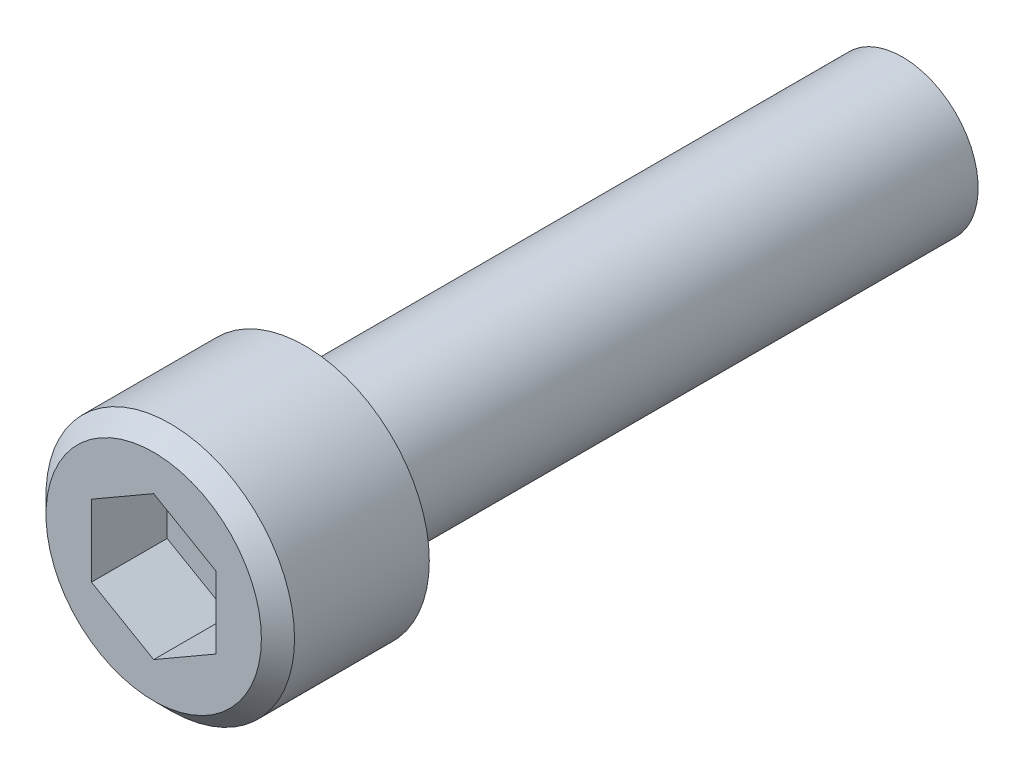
ISO-10303-21;
HEADER;
FILE_DESCRIPTION(('STEP AP214'),'2;1');
FILE_NAME('part.step','',(''),(''),'','','');
FILE_SCHEMA(('AUTOMOTIVE_DESIGN { 1 0 10303 214 1 1 1 1 }'));
ENDSEC;
DATA;
#1=APPLICATION_CONTEXT('core data for automotive mechanical design processes');
#2=APPLICATION_PROTOCOL_DEFINITION('international standard','automotive_design',2000,#1);
#3=PRODUCT_CONTEXT('',#1,'mechanical');
#4=PRODUCT('Part','Part','',(#3));
#5=PRODUCT_RELATED_PRODUCT_CATEGORY('part','',(#4));
#6=PRODUCT_DEFINITION_FORMATION('','',#4);
#7=PRODUCT_DEFINITION_CONTEXT('part definition',#1,'design');
#8=PRODUCT_DEFINITION('design','',#6,#7);
#9=PRODUCT_DEFINITION_SHAPE('','',#8);
#10=(LENGTH_UNIT() NAMED_UNIT(*) SI_UNIT(.MILLI.,.METRE.));
#11=(NAMED_UNIT(*) PLANE_ANGLE_UNIT() SI_UNIT($,.RADIAN.));
#12=(NAMED_UNIT(*) SI_UNIT($,.STERADIAN.) SOLID_ANGLE_UNIT());
#13=UNCERTAINTY_MEASURE_WITH_UNIT(LENGTH_MEASURE(1.E-05),#10,'distance_accuracy_value','');
#14=(GEOMETRIC_REPRESENTATION_CONTEXT(3) GLOBAL_UNCERTAINTY_ASSIGNED_CONTEXT((#13)) GLOBAL_UNIT_ASSIGNED_CONTEXT((#10,
#11,#12)) REPRESENTATION_CONTEXT('',''));
#15=CARTESIAN_POINT('',(0.,0.,0.));
#16=DIRECTION('',(0.,0.,1.));
#17=DIRECTION('',(1.,0.,0.));
#18=AXIS2_PLACEMENT_3D('',#15,#16,#17);
#19=CARTESIAN_POINT('',(8.88178419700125E-13,0.,19.0500000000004));
#20=DIRECTION('',(0.,0.,-1.));
#21=DIRECTION('',(-0.99999999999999,0.,0.));
#22=AXIS2_PLACEMENT_3D('',#19,#20,#21);
#23=CYLINDRICAL_SURFACE('',#22,2.413);
#24=CARTESIAN_POINT('',(8.88178419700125E-13,0.,18.6944000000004));
#25=DIRECTION('',(0.,0.,1.));
#26=DIRECTION('',(0.99999999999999,0.,0.));
#27=AXIS2_PLACEMENT_3D('',#24,#25,#26);
#28=CIRCLE('',#27,2.413);
#29=CARTESIAN_POINT('',(-2.41299999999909,0.,18.6944000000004));
#30=VERTEX_POINT('',#29);
#31=EDGE_CURVE('E149',#30,#30,#28,.F.);
#32=CARTESIAN_POINT('',(-1.11022302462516E-13,0.,0.));
#33=DIRECTION('',(0.,0.,1.));
#34=DIRECTION('',(0.99999999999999,0.,0.));
#35=AXIS2_PLACEMENT_3D('',#32,#33,#34);
#36=CIRCLE('',#35,2.413);
#37=CARTESIAN_POINT('',(-2.41299999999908,0.,0.));
#38=VERTEX_POINT('',#37);
#39=EDGE_CURVE('E143',#38,#38,#36,.T.);
#40=CARTESIAN_POINT('',(-2.41299999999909,0.,18.6944000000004));
#41=CARTESIAN_POINT('',(-2.41299999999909,0.,18.499666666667));
#42=CARTESIAN_POINT('',(-2.41299999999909,0.,18.3049333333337));
#43=CARTESIAN_POINT('',(-2.41299999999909,0.,17.915466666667));
#44=CARTESIAN_POINT('',(-2.41299999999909,0.,17.7207333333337));
#45=CARTESIAN_POINT('',(-2.41299999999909,0.,17.331266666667));
#46=CARTESIAN_POINT('',(-2.41299999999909,0.,17.1365333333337));
#47=CARTESIAN_POINT('',(-2.41299999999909,0.,16.747066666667));
#48=CARTESIAN_POINT('',(-2.41299999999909,0.,16.5523333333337));
#49=CARTESIAN_POINT('',(-2.41299999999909,0.,16.162866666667));
#50=CARTESIAN_POINT('',(-2.41299999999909,0.,15.9681333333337));
#51=CARTESIAN_POINT('',(-2.41299999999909,0.,15.578666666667));
#52=CARTESIAN_POINT('',(-2.41299999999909,0.,15.3839333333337));
#53=CARTESIAN_POINT('',(-2.41299999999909,0.,14.994466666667));
#54=CARTESIAN_POINT('',(-2.41299999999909,0.,14.7997333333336));
#55=CARTESIAN_POINT('',(-2.41299999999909,0.,14.410266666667));
#56=CARTESIAN_POINT('',(-2.41299999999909,0.,14.2155333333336));
#57=CARTESIAN_POINT('',(-2.41299999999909,0.,13.826066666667));
#58=CARTESIAN_POINT('',(-2.41299999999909,0.,13.6313333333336));
#59=CARTESIAN_POINT('',(-2.41299999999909,0.,13.2418666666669));
#60=CARTESIAN_POINT('',(-2.41299999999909,0.,13.0471333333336));
#61=CARTESIAN_POINT('',(-2.41299999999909,0.,12.6576666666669));
#62=CARTESIAN_POINT('',(-2.41299999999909,0.,12.4629333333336));
#63=CARTESIAN_POINT('',(-2.41299999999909,0.,12.0734666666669));
#64=CARTESIAN_POINT('',(-2.41299999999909,0.,11.8787333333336));
#65=CARTESIAN_POINT('',(-2.41299999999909,0.,11.4892666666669));
#66=CARTESIAN_POINT('',(-2.41299999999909,0.,11.2945333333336));
#67=CARTESIAN_POINT('',(-2.41299999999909,0.,10.9050666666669));
#68=CARTESIAN_POINT('',(-2.41299999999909,0.,10.7103333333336));
#69=CARTESIAN_POINT('',(-2.41299999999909,0.,10.3208666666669));
#70=CARTESIAN_POINT('',(-2.41299999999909,0.,10.1261333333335));
#71=CARTESIAN_POINT('',(-2.41299999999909,0.,9.73666666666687));
#72=CARTESIAN_POINT('',(-2.41299999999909,0.,9.54193333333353));
#73=CARTESIAN_POINT('',(-2.41299999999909,0.,9.15246666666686));
#74=CARTESIAN_POINT('',(-2.41299999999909,0.,8.95773333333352));
#75=CARTESIAN_POINT('',(-2.41299999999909,0.,8.56826666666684));
#76=CARTESIAN_POINT('',(-2.41299999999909,0.,8.3735333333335));
#77=CARTESIAN_POINT('',(-2.41299999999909,0.,7.98406666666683));
#78=CARTESIAN_POINT('',(-2.41299999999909,0.,7.78933333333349));
#79=CARTESIAN_POINT('',(-2.41299999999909,0.,7.39986666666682));
#80=CARTESIAN_POINT('',(-2.41299999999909,0.,7.20513333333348));
#81=CARTESIAN_POINT('',(-2.41299999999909,0.,6.81566666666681));
#82=CARTESIAN_POINT('',(-2.41299999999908,0.,6.62093333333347));
#83=CARTESIAN_POINT('',(-2.41299999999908,0.,6.23146666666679));
#84=CARTESIAN_POINT('',(-2.41299999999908,0.,6.03673333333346));
#85=CARTESIAN_POINT('',(-2.41299999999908,0.,5.64726666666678));
#86=CARTESIAN_POINT('',(-2.41299999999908,0.,5.45253333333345));
#87=CARTESIAN_POINT('',(-2.41299999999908,0.,5.06306666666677));
#88=CARTESIAN_POINT('',(-2.41299999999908,0.,4.86833333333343));
#89=CARTESIAN_POINT('',(-2.41299999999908,0.,4.47886666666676));
#90=CARTESIAN_POINT('',(-2.41299999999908,0.,4.28413333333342));
#91=CARTESIAN_POINT('',(-2.41299999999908,0.,3.89466666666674));
#92=CARTESIAN_POINT('',(-2.41299999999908,0.,3.69993333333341));
#93=CARTESIAN_POINT('',(-2.41299999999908,0.,3.31046666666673));
#94=CARTESIAN_POINT('',(-2.41299999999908,0.,3.1157333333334));
#95=CARTESIAN_POINT('',(-2.41299999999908,0.,2.72626666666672));
#96=CARTESIAN_POINT('',(-2.41299999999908,0.,2.53153333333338));
#97=CARTESIAN_POINT('',(-2.41299999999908,0.,2.14206666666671));
#98=CARTESIAN_POINT('',(-2.41299999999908,0.,1.94733333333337));
#99=CARTESIAN_POINT('',(-2.41299999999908,0.,1.5578666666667));
#100=CARTESIAN_POINT('',(-2.41299999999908,0.,1.36313333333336));
#101=CARTESIAN_POINT('',(-2.41299999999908,0.,0.973666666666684));
#102=CARTESIAN_POINT('',(-2.41299999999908,0.,0.778933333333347));
#103=CARTESIAN_POINT('',(-2.41299999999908,0.,0.389466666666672));
#104=CARTESIAN_POINT('',(-2.41299999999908,0.,0.194733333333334));
#105=CARTESIAN_POINT('',(-2.41299999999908,0.,0.));
#106=B_SPLINE_CURVE_WITH_KNOTS('',3,(#40,#41,#42,#43,#44,#45,#46,#47,#48,#49,#50,#51,#52,#53,
#54,#55,#56,#57,#58,#59,#60,#61,#62,#63,#64,#65,#66,#67,#68,#69,#70,#71,#72,#73,#74,#75,#76,#77,
#78,#79,#80,#81,#82,#83,#84,#85,#86,#87,#88,#89,#90,#91,#92,#93,#94,#95,#96,#97,#98,#99,#100,
#101,#102,#103,#104,#105),.UNSPECIFIED.,.F.,.F.,(4,2,2,2,2,2,2,2,2,2,2,2,2,2,2,2,2,2,2,2,2,2,2,
2,2,2,2,2,2,2,2,2,4),(0.,0.58420000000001,1.16840000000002,1.75260000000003,2.33680000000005,
2.92100000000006,3.50520000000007,4.08940000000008,4.6736000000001,5.25780000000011,
5.84200000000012,6.42620000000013,7.01040000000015,7.59460000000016,8.17880000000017,
8.76300000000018,9.34720000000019,9.9314000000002,10.5156000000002,11.0998000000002,
11.6840000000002,12.2682000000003,12.8524000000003,13.4366000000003,14.0208000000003,
14.6050000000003,15.1892000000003,15.7734000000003,16.3576000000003,16.9418000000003,
17.5260000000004,18.1102000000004,18.6944000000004),.UNSPECIFIED.);
#107=EDGE_CURVE('BSEAM36',#30,#38,#106,.T.);
#108=ORIENTED_EDGE('',*,*,#31,.T.);
#109=ORIENTED_EDGE('',*,*,#39,.T.);
#110=ORIENTED_EDGE('',*,*,#107,.T.);
#111=ORIENTED_EDGE('',*,*,#107,.F.);
#112=EDGE_LOOP('',(#108,#110,#109,#111));
#113=FACE_BOUND('',#112,.T.);
#114=ADVANCED_FACE('F36',(#113),#23,.T.);
#115=CARTESIAN_POINT('',(-1.11022302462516E-13,0.,0.));
#116=DIRECTION('',(0.,0.,1.));
#117=DIRECTION('',(0.99999999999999,0.,0.));
#118=AXIS2_PLACEMENT_3D('',#115,#116,#117);
#119=PLANE('',#118);
#120=ORIENTED_EDGE('',*,*,#39,.F.);
#121=EDGE_LOOP('',(#120));
#122=FACE_BOUND('',#121,.T.);
#123=ADVANCED_FACE('F167',(#122),#119,.F.);
#124=CARTESIAN_POINT('',(8.88178419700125E-13,0.,19.0500000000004));
#125=DIRECTION('',(0.,0.,1.));
#126=DIRECTION('',(0.99999999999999,0.,0.));
#127=AXIS2_PLACEMENT_3D('',#124,#125,#126);
#128=PLANE('',#127);
#129=CARTESIAN_POINT('',(8.88178419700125E-13,0.,19.0500000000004));
#130=DIRECTION('',(0.,0.,1.));
#131=DIRECTION('',(0.99999999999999,0.,0.));
#132=AXIS2_PLACEMENT_3D('',#129,#130,#131);
#133=CIRCLE('',#132,2.7686);
#134=CARTESIAN_POINT('',(2.76860000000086,0.,19.0500000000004));
#135=VERTEX_POINT('',#134);
#136=EDGE_CURVE('E146',#135,#135,#133,.T.);
#137=ORIENTED_EDGE('',*,*,#136,.T.);
#138=EDGE_LOOP('',(#137));
#139=FACE_BOUND('',#138,.T.);
#140=CARTESIAN_POINT('',(8.88178419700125E-13,0.,19.0500000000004));
#141=DIRECTION('',(0.,0.,1.));
#142=DIRECTION('',(0.99999999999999,0.,0.));
#143=AXIS2_PLACEMENT_3D('',#140,#141,#142);
#144=CIRCLE('',#143,3.9624);
#145=CARTESIAN_POINT('',(3.96240000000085,0.,19.0500000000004));
#146=VERTEX_POINT('',#145);
#147=EDGE_CURVE('E134',#146,#146,#144,.T.);
#148=ORIENTED_EDGE('',*,*,#147,.F.);
#149=EDGE_LOOP('',(#148));
#150=FACE_BOUND('',#149,.T.);
#151=ADVANCED_FACE('F172',(#139,#150),#128,.F.);
#152=CARTESIAN_POINT('',(8.88178419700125E-13,0.,23.8760000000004));
#153=DIRECTION('',(0.,0.,-1.));
#154=DIRECTION('',(-0.99999999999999,0.,0.));
#155=AXIS2_PLACEMENT_3D('',#152,#153,#154);
#156=CYLINDRICAL_SURFACE('',#155,3.9624);
#157=CARTESIAN_POINT('',(8.88178419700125E-13,0.,23.3476800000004));
#158=DIRECTION('',(0.,0.,1.));
#159=DIRECTION('',(0.99999999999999,0.,0.));
#160=AXIS2_PLACEMENT_3D('',#157,#158,#159);
#161=CIRCLE('',#160,3.9624);
#162=CARTESIAN_POINT('',(3.96240000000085,0.,23.3476800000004));
#163=VERTEX_POINT('',#162);
#164=EDGE_CURVE('E11',#163,#163,#161,.F.);
#165=ORIENTED_EDGE('',*,*,#164,.T.);
#166=EDGE_LOOP('',(#165));
#167=FACE_BOUND('',#166,.T.);
#168=ORIENTED_EDGE('',*,*,#147,.T.);
#169=EDGE_LOOP('',(#168));
#170=FACE_BOUND('',#169,.T.);
#171=ADVANCED_FACE('F187',(#167,#170),#156,.T.);
#172=CARTESIAN_POINT('',(8.88178419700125E-13,0.,23.8760000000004));
#173=DIRECTION('',(0.,0.,1.));
#174=DIRECTION('',(0.99999999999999,0.,0.));
#175=AXIS2_PLACEMENT_3D('',#172,#173,#174);
#176=PLANE('',#175);
#177=CARTESIAN_POINT('',(8.88178419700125E-13,0.,23.8760000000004));
#178=DIRECTION('',(0.,0.,1.));
#179=DIRECTION('',(0.99999999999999,0.,0.));
#180=AXIS2_PLACEMENT_3D('',#177,#178,#179);
#181=CIRCLE('',#180,3.43407999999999);
#182=CARTESIAN_POINT('',(3.43408000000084,0.,23.8760000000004));
#183=VERTEX_POINT('',#182);
#184=EDGE_CURVE('E43',#183,#183,#181,.T.);
#185=ORIENTED_EDGE('',*,*,#184,.T.);
#186=EDGE_LOOP('',(#185));
#187=FACE_BOUND('',#186,.T.);
#188=DIRECTION('',(-0.866025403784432,-0.499999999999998,0.));
#189=VECTOR('',#188,1.);
#190=CARTESIAN_POINT('',(8.32667268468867E-13,2.29135888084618,23.8760000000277));
#191=LINE('',#190,#189);
#192=CARTESIAN_POINT('',(8.32667268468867E-13,2.29135888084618,23.8760000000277));
#193=VERTEX_POINT('',#192);
#194=CARTESIAN_POINT('',(-1.9843749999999,1.14567944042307,23.8760000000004));
#195=VERTEX_POINT('',#194);
#196=EDGE_CURVE('E50',#193,#195,#191,.T.);
#197=ORIENTED_EDGE('',*,*,#196,.F.);
#198=DIRECTION('',(0.866025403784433,-0.499999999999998,0.));
#199=VECTOR('',#198,1.);
#200=CARTESIAN_POINT('',(8.32667268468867E-13,2.29135888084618,23.8760000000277));
#201=LINE('',#200,#199);
#202=CARTESIAN_POINT('',(1.98437500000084,1.14567944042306,23.8760000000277));
#203=VERTEX_POINT('',#202);
#204=EDGE_CURVE('E117',#193,#203,#201,.T.);
#205=ORIENTED_EDGE('',*,*,#204,.T.);
#206=DIRECTION('',(0.,-0.999999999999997,0.));
#207=VECTOR('',#206,1.);
#208=CARTESIAN_POINT('',(1.98437500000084,1.14567944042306,23.8760000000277));
#209=LINE('',#208,#207);
#210=CARTESIAN_POINT('',(1.98437500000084,-1.14567944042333,23.8760000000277));
#211=VERTEX_POINT('',#210);
#212=EDGE_CURVE('E112',#203,#211,#209,.T.);
#213=ORIENTED_EDGE('',*,*,#212,.T.);
#214=DIRECTION('',(0.866025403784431,0.499999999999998,0.));
#215=VECTOR('',#214,1.);
#216=CARTESIAN_POINT('',(8.32667268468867E-13,-2.29135888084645,23.8760000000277));
#217=LINE('',#216,#215);
#218=CARTESIAN_POINT('',(8.32667268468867E-13,-2.29135888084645,23.8760000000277));
#219=VERTEX_POINT('',#218);
#220=EDGE_CURVE('E110',#219,#211,#217,.T.);
#221=ORIENTED_EDGE('',*,*,#220,.F.);
#222=DIRECTION('',(-0.866025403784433,0.499999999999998,0.));
#223=VECTOR('',#222,1.);
#224=CARTESIAN_POINT('',(8.32667268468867E-13,-2.29135888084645,23.8760000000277));
#225=LINE('',#224,#223);
#226=CARTESIAN_POINT('',(-1.98437499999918,-1.14567944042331,23.8760000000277));
#227=VERTEX_POINT('',#226);
#228=EDGE_CURVE('E92',#219,#227,#225,.T.);
#229=ORIENTED_EDGE('',*,*,#228,.T.);
#230=DIRECTION('',(0.,-0.999999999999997,0.));
#231=VECTOR('',#230,1.);
#232=CARTESIAN_POINT('',(-1.9843749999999,1.14567944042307,23.8760000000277));
#233=LINE('',#232,#231);
#234=EDGE_CURVE('E103',#195,#227,#233,.T.);
#235=ORIENTED_EDGE('',*,*,#234,.F.);
#236=EDGE_LOOP('',(#197,#205,#213,#221,#229,#235));
#237=FACE_BOUND('',#236,.T.);
#238=ADVANCED_FACE('F107',(#187,#237),#176,.T.);
#239=CARTESIAN_POINT('',(8.88178419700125E-13,0.,18.6944000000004));
#240=DIRECTION('',(0.,0.,1.));
#241=DIRECTION('',(0.99999999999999,0.,0.));
#242=AXIS2_PLACEMENT_3D('',#239,#240,#241);
#243=TOROIDAL_SURFACE('',#242,2.7686,0.3556);
#244=ORIENTED_EDGE('',*,*,#31,.F.);
#245=EDGE_LOOP('',(#244));
#246=FACE_BOUND('',#245,.T.);
#247=ORIENTED_EDGE('',*,*,#136,.F.);
#248=EDGE_LOOP('',(#247));
#249=FACE_BOUND('',#248,.T.);
#250=ADVANCED_FACE('F178',(#246,#249),#243,.F.);
#251=CARTESIAN_POINT('',(8.32667268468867E-13,2.29135888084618,21.4630000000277));
#252=DIRECTION('',(-0.499999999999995,0.866025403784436,0.));
#253=DIRECTION('',(-0.866025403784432,-0.499999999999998,0.));
#254=AXIS2_PLACEMENT_3D('',#251,#252,#253);
#255=PLANE('',#254);
#256=ORIENTED_EDGE('',*,*,#196,.T.);
#257=DIRECTION('',(0.,0.,1.));
#258=VECTOR('',#257,1.);
#259=CARTESIAN_POINT('',(-1.9843749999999,1.14567944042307,21.4630000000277));
#260=LINE('',#259,#258);
#261=CARTESIAN_POINT('',(-1.9843749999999,1.14567944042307,21.4630000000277));
#262=VERTEX_POINT('',#261);
#263=EDGE_CURVE('E100',#262,#195,#260,.T.);
#264=ORIENTED_EDGE('',*,*,#263,.F.);
#265=DIRECTION('',(-0.866025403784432,-0.499999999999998,0.));
#266=VECTOR('',#265,1.);
#267=CARTESIAN_POINT('',(8.32667268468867E-13,2.29135888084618,21.4630000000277));
#268=LINE('',#267,#266);
#269=CARTESIAN_POINT('',(8.32667268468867E-13,2.29135888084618,21.4630000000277));
#270=VERTEX_POINT('',#269);
#271=EDGE_CURVE('E120',#270,#262,#268,.T.);
#272=ORIENTED_EDGE('',*,*,#271,.F.);
#273=DIRECTION('',(0.,0.,1.));
#274=VECTOR('',#273,1.);
#275=CARTESIAN_POINT('',(8.32667268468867E-13,2.29135888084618,21.4630000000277));
#276=LINE('',#275,#274);
#277=EDGE_CURVE('E57',#270,#193,#276,.T.);
#278=ORIENTED_EDGE('',*,*,#277,.T.);
#279=EDGE_LOOP('',(#256,#264,#272,#278));
#280=FACE_BOUND('',#279,.T.);
#281=ADVANCED_FACE('F181',(#280),#255,.F.);
#282=CARTESIAN_POINT('',(8.32667268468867E-13,2.29135888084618,21.4630000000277));
#283=DIRECTION('',(-0.499999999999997,-0.866025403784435,0.));
#284=DIRECTION('',(0.866025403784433,-0.499999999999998,0.));
#285=AXIS2_PLACEMENT_3D('',#282,#283,#284);
#286=PLANE('',#285);
#287=ORIENTED_EDGE('',*,*,#204,.F.);
#288=ORIENTED_EDGE('',*,*,#277,.F.);
#289=DIRECTION('',(0.866025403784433,-0.499999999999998,0.));
#290=VECTOR('',#289,1.);
#291=CARTESIAN_POINT('',(8.32667268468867E-13,2.29135888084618,21.4630000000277));
#292=LINE('',#291,#290);
#293=CARTESIAN_POINT('',(1.98437500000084,1.14567944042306,21.4630000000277));
#294=VERTEX_POINT('',#293);
#295=EDGE_CURVE('E131',#270,#294,#292,.T.);
#296=ORIENTED_EDGE('',*,*,#295,.T.);
#297=DIRECTION('',(0.,0.,1.));
#298=VECTOR('',#297,1.);
#299=CARTESIAN_POINT('',(1.98437500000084,1.14567944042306,21.4630000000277));
#300=LINE('',#299,#298);
#301=EDGE_CURVE('E135',#294,#203,#300,.T.);
#302=ORIENTED_EDGE('',*,*,#301,.T.);
#303=EDGE_LOOP('',(#287,#288,#296,#302));
#304=FACE_BOUND('',#303,.T.);
#305=ADVANCED_FACE('F201',(#304),#286,.T.);
#306=CARTESIAN_POINT('',(1.98437500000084,1.14567944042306,21.4630000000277));
#307=DIRECTION('',(-0.99999999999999,0.,0.));
#308=DIRECTION('',(0.,-0.999999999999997,0.));
#309=AXIS2_PLACEMENT_3D('',#306,#307,#308);
#310=PLANE('',#309);
#311=ORIENTED_EDGE('',*,*,#212,.F.);
#312=ORIENTED_EDGE('',*,*,#301,.F.);
#313=DIRECTION('',(0.,-0.999999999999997,0.));
#314=VECTOR('',#313,1.);
#315=CARTESIAN_POINT('',(1.98437500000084,1.14567944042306,21.4630000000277));
#316=LINE('',#315,#314);
#317=CARTESIAN_POINT('',(1.98437500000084,-1.14567944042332,21.4630000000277));
#318=VERTEX_POINT('',#317);
#319=EDGE_CURVE('E129',#294,#318,#316,.T.);
#320=ORIENTED_EDGE('',*,*,#319,.T.);
#321=DIRECTION('',(0.,0.,1.));
#322=VECTOR('',#321,1.);
#323=CARTESIAN_POINT('',(1.98437500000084,-1.14567944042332,21.4630000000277));
#324=LINE('',#323,#322);
#325=EDGE_CURVE('E137',#318,#211,#324,.T.);
#326=ORIENTED_EDGE('',*,*,#325,.T.);
#327=EDGE_LOOP('',(#311,#312,#320,#326));
#328=FACE_BOUND('',#327,.T.);
#329=ADVANCED_FACE('F209',(#328),#310,.T.);
#330=CARTESIAN_POINT('',(8.32667268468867E-13,-2.29135888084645,21.4630000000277));
#331=DIRECTION('',(0.499999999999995,-0.866025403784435,0.));
#332=DIRECTION('',(0.866025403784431,0.499999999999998,0.));
#333=AXIS2_PLACEMENT_3D('',#330,#331,#332);
#334=PLANE('',#333);
#335=ORIENTED_EDGE('',*,*,#220,.T.);
#336=ORIENTED_EDGE('',*,*,#325,.F.);
#337=DIRECTION('',(0.866025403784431,0.499999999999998,0.));
#338=VECTOR('',#337,1.);
#339=CARTESIAN_POINT('',(8.32667268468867E-13,-2.29135888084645,21.4630000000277));
#340=LINE('',#339,#338);
#341=CARTESIAN_POINT('',(8.32667268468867E-13,-2.29135888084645,21.4630000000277));
#342=VERTEX_POINT('',#341);
#343=EDGE_CURVE('E126',#342,#318,#340,.T.);
#344=ORIENTED_EDGE('',*,*,#343,.F.);
#345=DIRECTION('',(0.,0.,1.));
#346=VECTOR('',#345,1.);
#347=CARTESIAN_POINT('',(8.32667268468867E-13,-2.29135888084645,21.4630000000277));
#348=LINE('',#347,#346);
#349=EDGE_CURVE('E99',#342,#219,#348,.T.);
#350=ORIENTED_EDGE('',*,*,#349,.T.);
#351=EDGE_LOOP('',(#335,#336,#344,#350));
#352=FACE_BOUND('',#351,.T.);
#353=ADVANCED_FACE('F206',(#352),#334,.F.);
#354=CARTESIAN_POINT('',(8.32667268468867E-13,-2.29135888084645,21.4630000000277));
#355=DIRECTION('',(0.499999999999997,0.866025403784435,0.));
#356=DIRECTION('',(-0.866025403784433,0.499999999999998,0.));
#357=AXIS2_PLACEMENT_3D('',#354,#355,#356);
#358=PLANE('',#357);
#359=ORIENTED_EDGE('',*,*,#228,.F.);
#360=ORIENTED_EDGE('',*,*,#349,.F.);
#361=DIRECTION('',(-0.866025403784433,0.499999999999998,0.));
#362=VECTOR('',#361,1.);
#363=CARTESIAN_POINT('',(8.32667268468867E-13,-2.29135888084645,21.4630000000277));
#364=LINE('',#363,#362);
#365=CARTESIAN_POINT('',(-1.98437499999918,-1.14567944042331,21.4630000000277));
#366=VERTEX_POINT('',#365);
#367=EDGE_CURVE('E95',#342,#366,#364,.T.);
#368=ORIENTED_EDGE('',*,*,#367,.T.);
#369=DIRECTION('',(0.,0.,1.));
#370=VECTOR('',#369,1.);
#371=CARTESIAN_POINT('',(-1.98437499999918,-1.14567944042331,21.4630000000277));
#372=LINE('',#371,#370);
#373=EDGE_CURVE('E88',#366,#227,#372,.T.);
#374=ORIENTED_EDGE('',*,*,#373,.T.);
#375=EDGE_LOOP('',(#359,#360,#368,#374));
#376=FACE_BOUND('',#375,.T.);
#377=ADVANCED_FACE('F90',(#376),#358,.T.);
#378=CARTESIAN_POINT('',(-1.9843749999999,1.14567944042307,21.4630000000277));
#379=DIRECTION('',(-0.99999999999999,0.,0.));
#380=DIRECTION('',(0.,0.,1.));
#381=AXIS2_PLACEMENT_3D('',#378,#379,#380);
#382=PLANE('',#381);
#383=ORIENTED_EDGE('',*,*,#234,.T.);
#384=ORIENTED_EDGE('',*,*,#373,.F.);
#385=DIRECTION('',(0.,-0.999999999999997,0.));
#386=VECTOR('',#385,1.);
#387=CARTESIAN_POINT('',(-1.9843749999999,1.14567944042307,21.4630000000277));
#388=LINE('',#387,#386);
#389=EDGE_CURVE('E123',#262,#366,#388,.T.);
#390=ORIENTED_EDGE('',*,*,#389,.F.);
#391=ORIENTED_EDGE('',*,*,#263,.T.);
#392=EDGE_LOOP('',(#383,#384,#390,#391));
#393=FACE_BOUND('',#392,.T.);
#394=ADVANCED_FACE('F104',(#393),#382,.F.);
#395=CARTESIAN_POINT('',(-3.96874999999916,-1.00613961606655E-13,21.4630000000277));
#396=DIRECTION('',(0.,0.,-1.));
#397=DIRECTION('',(-0.99999999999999,0.,0.));
#398=AXIS2_PLACEMENT_3D('',#395,#396,#397);
#399=PLANE('',#398);
#400=ORIENTED_EDGE('',*,*,#271,.T.);
#401=ORIENTED_EDGE('',*,*,#389,.T.);
#402=ORIENTED_EDGE('',*,*,#367,.F.);
#403=ORIENTED_EDGE('',*,*,#343,.T.);
#404=ORIENTED_EDGE('',*,*,#319,.F.);
#405=ORIENTED_EDGE('',*,*,#295,.F.);
#406=EDGE_LOOP('',(#400,#401,#402,#403,#404,#405));
#407=FACE_BOUND('',#406,.T.);
#408=ADVANCED_FACE('F157',(#407),#399,.F.);
#409=CARTESIAN_POINT('',(8.88178419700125E-13,0.,23.8760000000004));
#410=DIRECTION('',(0.,0.,-1.));
#411=DIRECTION('',(-0.99999999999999,0.,0.));
#412=AXIS2_PLACEMENT_3D('',#409,#410,#411);
#413=CONICAL_SURFACE('',#412,3.43407999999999,0.785398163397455);
#414=ORIENTED_EDGE('',*,*,#164,.F.);
#415=EDGE_LOOP('',(#414));
#416=FACE_BOUND('',#415,.T.);
#417=ORIENTED_EDGE('',*,*,#184,.F.);
#418=EDGE_LOOP('',(#417));
#419=FACE_BOUND('',#418,.T.);
#420=ADVANCED_FACE('F155',(#416,#419),#413,.T.);
#421=CLOSED_SHELL('',(#114,#123,#151,#171,#238,#250,#281,#305,#329,#353,#377,#394,#408,#420));
#422=MANIFOLD_SOLID_BREP('B2',#421);
#423=ADVANCED_BREP_SHAPE_REPRESENTATION('',(#18,#422),#14);
#424=SHAPE_DEFINITION_REPRESENTATION(#9,#423);
ENDSEC;
END-ISO-10303-21;
